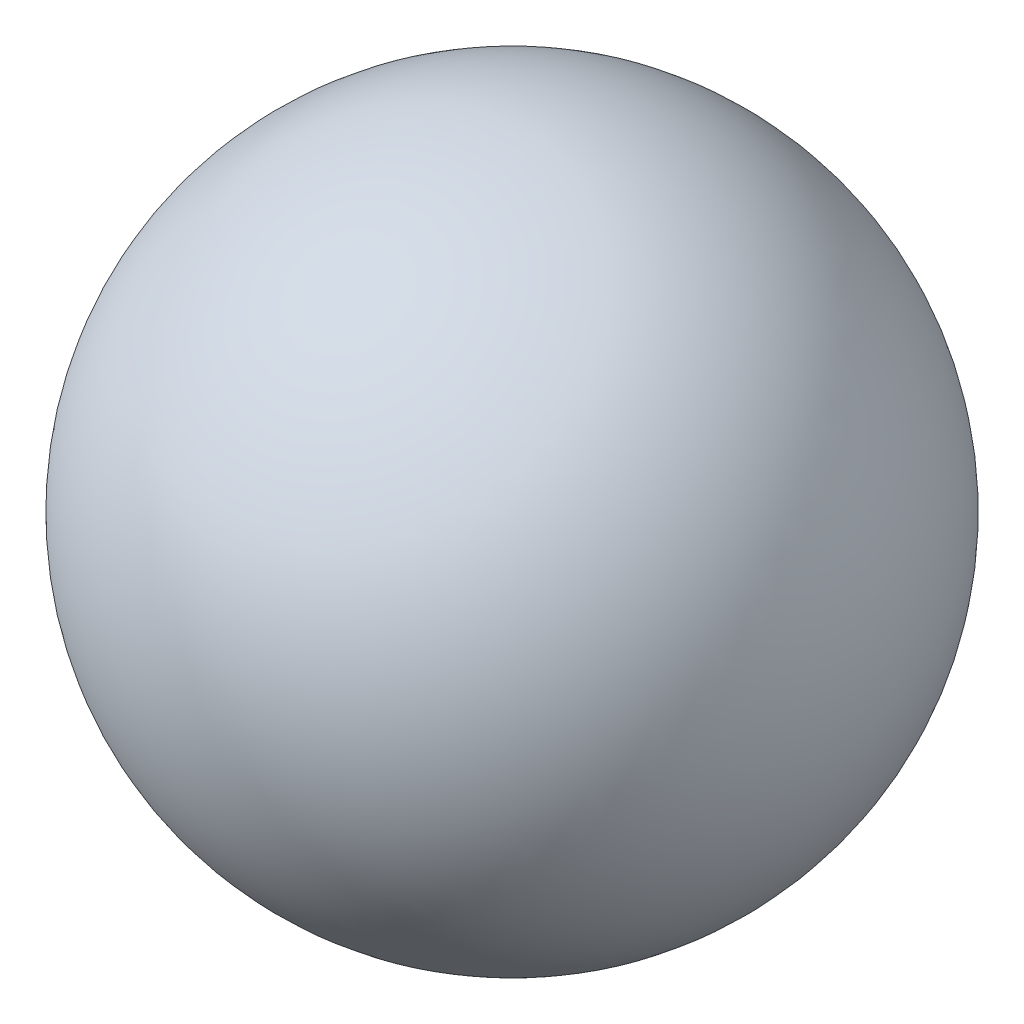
ISO-10303-21;
HEADER;
FILE_DESCRIPTION(('STEP AP214'),'2;1');
FILE_NAME('part.step','',(''),(''),'','','');
FILE_SCHEMA(('AUTOMOTIVE_DESIGN { 1 0 10303 214 1 1 1 1 }'));
ENDSEC;
DATA;
#1=APPLICATION_CONTEXT('core data for automotive mechanical design processes');
#2=APPLICATION_PROTOCOL_DEFINITION('international standard','automotive_design',2000,#1);
#3=PRODUCT_CONTEXT('',#1,'mechanical');
#4=PRODUCT('Part','Part','',(#3));
#5=PRODUCT_RELATED_PRODUCT_CATEGORY('part','',(#4));
#6=PRODUCT_DEFINITION_FORMATION('','',#4);
#7=PRODUCT_DEFINITION_CONTEXT('part definition',#1,'design');
#8=PRODUCT_DEFINITION('design','',#6,#7);
#9=PRODUCT_DEFINITION_SHAPE('','',#8);
#10=(LENGTH_UNIT() NAMED_UNIT(*) SI_UNIT(.MILLI.,.METRE.));
#11=(NAMED_UNIT(*) PLANE_ANGLE_UNIT() SI_UNIT($,.RADIAN.));
#12=(NAMED_UNIT(*) SI_UNIT($,.STERADIAN.) SOLID_ANGLE_UNIT());
#13=UNCERTAINTY_MEASURE_WITH_UNIT(LENGTH_MEASURE(1.E-05),#10,'distance_accuracy_value','');
#14=(GEOMETRIC_REPRESENTATION_CONTEXT(3) GLOBAL_UNCERTAINTY_ASSIGNED_CONTEXT((#13)) GLOBAL_UNIT_ASSIGNED_CONTEXT((#10,
#11,#12)) REPRESENTATION_CONTEXT('',''));
#15=CARTESIAN_POINT('',(0.,0.,0.));
#16=DIRECTION('',(0.,0.,1.));
#17=DIRECTION('',(1.,0.,0.));
#18=AXIS2_PLACEMENT_3D('',#15,#16,#17);
#19=CARTESIAN_POINT('',(0.,0.,0.));
#20=DIRECTION('',(0.,1.,0.));
#21=DIRECTION('',(1.,0.,0.));
#22=AXIS2_PLACEMENT_3D('',#19,#20,#21);
#23=SPHERICAL_SURFACE('',#22,201.6252);
#24=CARTESIAN_POINT('',(0.,201.6252,0.));
#25=VERTEX_POINT('',#24);
#26=VERTEX_LOOP('',#25);
#27=FACE_BOUND('',#26,.T.);
#28=ADVANCED_FACE('F30',(#27),#23,.T.);
#29=CLOSED_SHELL('',(#28));
#30=MANIFOLD_SOLID_BREP('B2',#29);
#31=ADVANCED_BREP_SHAPE_REPRESENTATION('',(#18,#30),#14);
#32=SHAPE_DEFINITION_REPRESENTATION(#9,#31);
ENDSEC;
END-ISO-10303-21;
